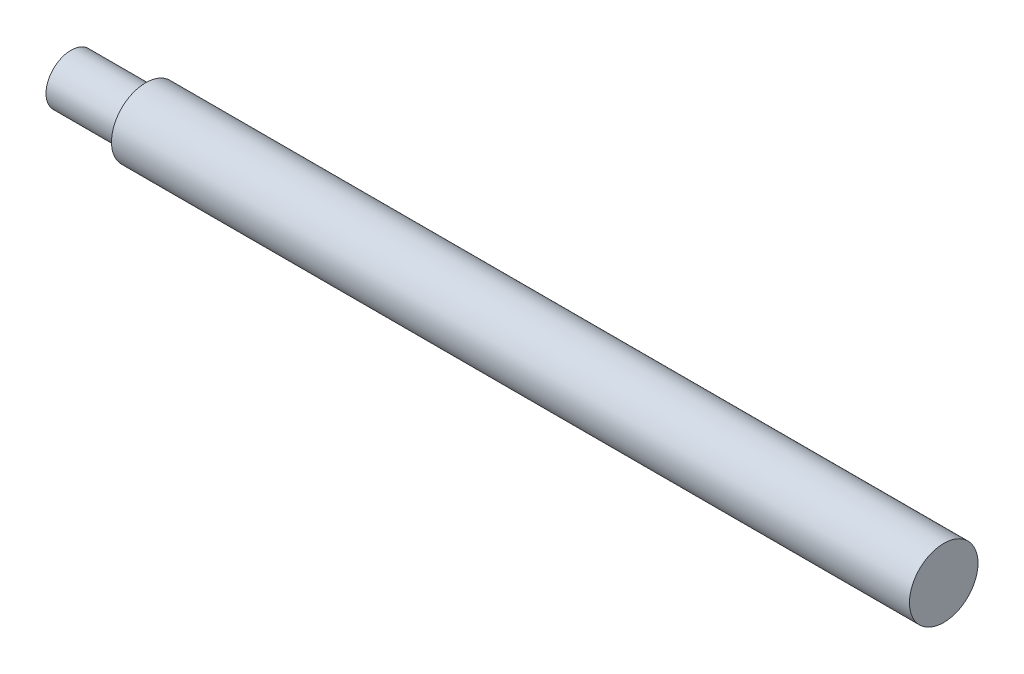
ISO-10303-21;
HEADER;
FILE_DESCRIPTION(('STEP AP214'),'2;1');
FILE_NAME('part.step','',(''),(''),'','','');
FILE_SCHEMA(('AUTOMOTIVE_DESIGN { 1 0 10303 214 1 1 1 1 }'));
ENDSEC;
DATA;
#1=APPLICATION_CONTEXT('core data for automotive mechanical design processes');
#2=APPLICATION_PROTOCOL_DEFINITION('international standard','automotive_design',2000,#1);
#3=PRODUCT_CONTEXT('',#1,'mechanical');
#4=PRODUCT('Part','Part','',(#3));
#5=PRODUCT_RELATED_PRODUCT_CATEGORY('part','',(#4));
#6=PRODUCT_DEFINITION_FORMATION('','',#4);
#7=PRODUCT_DEFINITION_CONTEXT('part definition',#1,'design');
#8=PRODUCT_DEFINITION('design','',#6,#7);
#9=PRODUCT_DEFINITION_SHAPE('','',#8);
#10=(LENGTH_UNIT() NAMED_UNIT(*) SI_UNIT(.MILLI.,.METRE.));
#11=(NAMED_UNIT(*) PLANE_ANGLE_UNIT() SI_UNIT($,.RADIAN.));
#12=(NAMED_UNIT(*) SI_UNIT($,.STERADIAN.) SOLID_ANGLE_UNIT());
#13=UNCERTAINTY_MEASURE_WITH_UNIT(LENGTH_MEASURE(1.E-05),#10,'distance_accuracy_value','');
#14=(GEOMETRIC_REPRESENTATION_CONTEXT(3) GLOBAL_UNCERTAINTY_ASSIGNED_CONTEXT((#13)) GLOBAL_UNIT_ASSIGNED_CONTEXT((#10,
#11,#12)) REPRESENTATION_CONTEXT('',''));
#15=CARTESIAN_POINT('',(0.,0.,0.));
#16=DIRECTION('',(0.,0.,1.));
#17=DIRECTION('',(1.,0.,0.));
#18=AXIS2_PLACEMENT_3D('',#15,#16,#17);
#19=CARTESIAN_POINT('',(-444.500000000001,0.,1.66533453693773E-13));
#20=DIRECTION('',(1.,0.,0.));
#21=DIRECTION('',(0.,0.,-1.));
#22=AXIS2_PLACEMENT_3D('',#19,#20,#21);
#23=CYLINDRICAL_SURFACE('',#22,12.7);
#24=CARTESIAN_POINT('',(-444.500000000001,0.,1.66533453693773E-13));
#25=DIRECTION('',(-1.,0.,0.));
#26=DIRECTION('',(0.,0.,1.));
#27=AXIS2_PLACEMENT_3D('',#24,#25,#26);
#28=CIRCLE('',#27,12.7);
#29=CARTESIAN_POINT('',(-444.500000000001,0.,12.7000000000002));
#30=VERTEX_POINT('',#29);
#31=EDGE_CURVE('E47',#30,#30,#28,.T.);
#32=ORIENTED_EDGE('',*,*,#31,.F.);
#33=EDGE_LOOP('',(#32));
#34=FACE_BOUND('',#33,.T.);
#35=CARTESIAN_POINT('',(-406.400000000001,2.77555756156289E-13,4.16333634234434E-13));
#36=DIRECTION('',(1.,0.,0.));
#37=DIRECTION('',(0.,0.,-1.));
#38=AXIS2_PLACEMENT_3D('',#35,#36,#37);
#39=CIRCLE('',#38,12.7);
#40=CARTESIAN_POINT('',(-406.400000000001,2.76145772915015E-13,-12.6999999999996));
#41=VERTEX_POINT('',#40);
#42=EDGE_CURVE('E10',#41,#41,#39,.F.);
#43=ORIENTED_EDGE('',*,*,#42,.T.);
#44=EDGE_LOOP('',(#43));
#45=FACE_BOUND('',#44,.T.);
#46=ADVANCED_FACE('F32',(#34,#45),#23,.T.);
#47=CARTESIAN_POINT('',(-444.500000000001,0.,1.66533453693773E-13));
#48=DIRECTION('',(-1.,0.,0.));
#49=DIRECTION('',(0.,0.,1.));
#50=AXIS2_PLACEMENT_3D('',#47,#48,#49);
#51=PLANE('',#50);
#52=ORIENTED_EDGE('',*,*,#31,.T.);
#53=EDGE_LOOP('',(#52));
#54=FACE_BOUND('',#53,.T.);
#55=ADVANCED_FACE('F53',(#54),#51,.T.);
#56=CARTESIAN_POINT('',(-406.400000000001,2.77555756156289E-13,4.16333634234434E-13));
#57=DIRECTION('',(1.,0.,0.));
#58=DIRECTION('',(0.,0.,-1.));
#59=AXIS2_PLACEMENT_3D('',#56,#57,#58);
#60=PLANE('',#59);
#61=CARTESIAN_POINT('',(-406.400000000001,2.77555756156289E-13,4.16333634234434E-13));
#62=DIRECTION('',(1.,0.,0.));
#63=DIRECTION('',(0.,0.,-1.));
#64=AXIS2_PLACEMENT_3D('',#61,#62,#63);
#65=CIRCLE('',#64,17.4625);
#66=CARTESIAN_POINT('',(-406.400000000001,2.75617029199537E-13,-17.4624999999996));
#67=VERTEX_POINT('',#66);
#68=EDGE_CURVE('E39',#67,#67,#65,.T.);
#69=ORIENTED_EDGE('',*,*,#68,.F.);
#70=EDGE_LOOP('',(#69));
#71=FACE_BOUND('',#70,.T.);
#72=ORIENTED_EDGE('',*,*,#42,.F.);
#73=EDGE_LOOP('',(#72));
#74=FACE_BOUND('',#73,.T.);
#75=ADVANCED_FACE('F57',(#71,#74),#60,.F.);
#76=CARTESIAN_POINT('',(-406.400000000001,2.77555756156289E-13,4.16333634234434E-13));
#77=DIRECTION('',(1.,0.,0.));
#78=DIRECTION('',(0.,0.,-1.));
#79=AXIS2_PLACEMENT_3D('',#76,#77,#78);
#80=CYLINDRICAL_SURFACE('',#79,17.4625);
#81=ORIENTED_EDGE('',*,*,#68,.T.);
#82=EDGE_LOOP('',(#81));
#83=FACE_BOUND('',#82,.T.);
#84=CARTESIAN_POINT('',(0.,0.,0.));
#85=DIRECTION('',(1.,0.,0.));
#86=DIRECTION('',(0.,0.,-1.));
#87=AXIS2_PLACEMENT_3D('',#84,#85,#86);
#88=CIRCLE('',#87,17.4625);
#89=CARTESIAN_POINT('',(0.,0.,-17.4625));
#90=VERTEX_POINT('',#89);
#91=EDGE_CURVE('E43',#90,#90,#88,.T.);
#92=ORIENTED_EDGE('',*,*,#91,.F.);
#93=EDGE_LOOP('',(#92));
#94=FACE_BOUND('',#93,.T.);
#95=ADVANCED_FACE('F34',(#83,#94),#80,.T.);
#96=CARTESIAN_POINT('',(0.,0.,0.));
#97=DIRECTION('',(1.,0.,0.));
#98=DIRECTION('',(0.,0.,-1.));
#99=AXIS2_PLACEMENT_3D('',#96,#97,#98);
#100=PLANE('',#99);
#101=ORIENTED_EDGE('',*,*,#91,.T.);
#102=EDGE_LOOP('',(#101));
#103=FACE_BOUND('',#102,.T.);
#104=ADVANCED_FACE('F68',(#103),#100,.T.);
#105=CLOSED_SHELL('',(#46,#55,#75,#95,#104));
#106=MANIFOLD_SOLID_BREP('B2',#105);
#107=ADVANCED_BREP_SHAPE_REPRESENTATION('',(#18,#106),#14);
#108=SHAPE_DEFINITION_REPRESENTATION(#9,#107);
ENDSEC;
END-ISO-10303-21;
